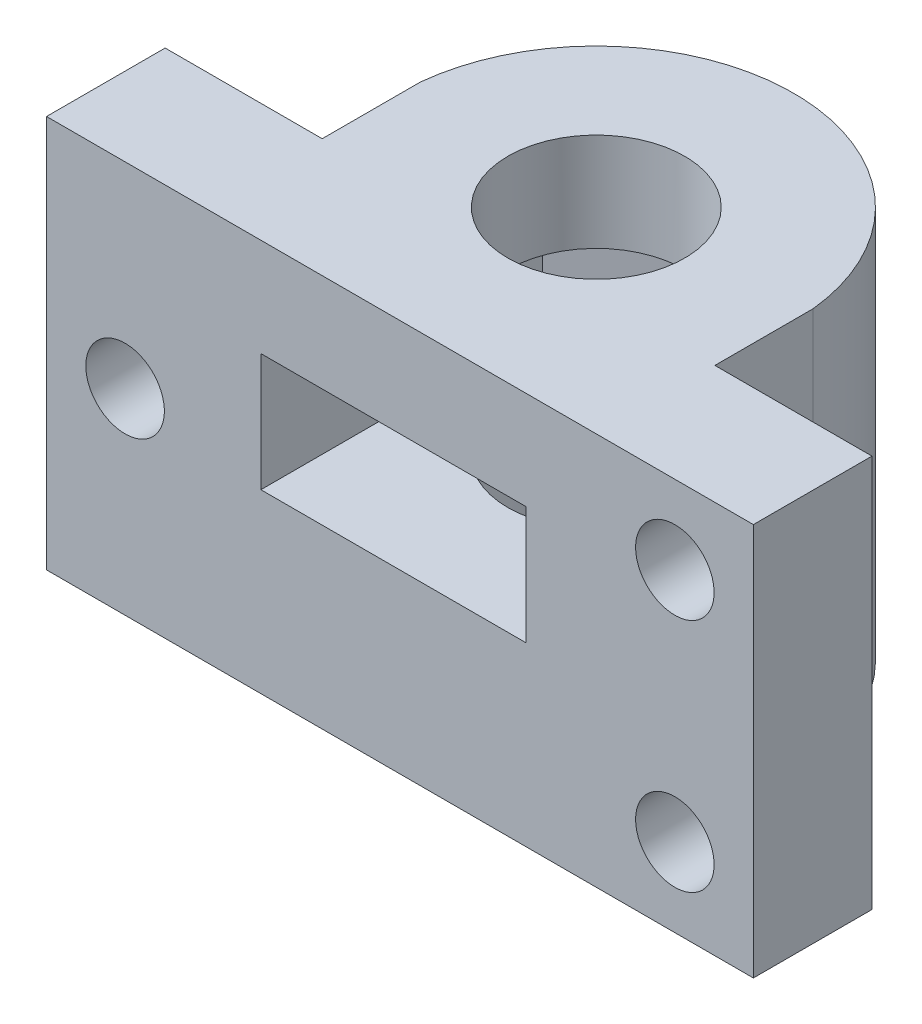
from build123d import *

# Parameters (mm, degrees)
SKETCH1_R           = 4.5
BOSS_EXTRUDE1_DEPTH = 20
CUT_EXTRUDE2_DEPTH  = 6
SKETCH9_R           = 2
CUT_EXTRUDE4_DEPTH  = 38.153619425
SKETCH10_W          = 13.49308662
SKETCH10_H          = 6.005400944
CUT_EXTRUDE5_DEPTH  = 10


with BuildPart() as part:
    # Sketch1 → Boss-Extrude1 (new body)
    with BuildSketch(Plane(origin=(0, 0, 0), x_dir=(1, 0, 0), z_dir=(0, 1, 0))):
        with BuildLine():
            Line((0, 0), (20, 0))
            Line((20, 0), (28, 0))
            Line((28, 0), (28, 6.039957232))
            Line((28, 6.039957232), (20, 6.039957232))
            Line((20, 6.039957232), (20, 11.039957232))
            ThreePointArc((20, 11.039957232), (10, 20.053930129), (0, 11.039957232))
            Line((0, 11.039957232), (0, 6.039957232))
            Line((0, 6.039957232), (-8, 6.039957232))
            Line((-8, 6.039957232), (-8, 0))
            Line((-8, 0), (0, 0))
        make_face()
        with Locations(Location((10, 10, 0), (0, 0, 270))):
            Circle(SKETCH1_R, mode=Mode.SUBTRACT)
    extrude(amount=BOSS_EXTRUDE1_DEPTH)

    # Sketch4 → Cut-Extrude2 (cut)
    with BuildSketch(Plane(origin=(0, 15, 0), x_dir=(1, 0, 0), z_dir=(0, 1, 0))):
        Polygon((10, 2.494446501), (16.5, 6.24722325), (16.5, 13.75277675), (10, 17.505553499), (3.5, 13.75277675), (3.5, 6.24722325), align=None)
    extrude(amount=-CUT_EXTRUDE2_DEPTH, mode=Mode.SUBTRACT)

    # Sketch9 → Cut-Extrude4 (cut, through all)
    with BuildSketch(Plane(origin=(0, 0, -6.039957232), x_dir=(-1, 0, 0), z_dir=(0, 0, -1))):
        with Locations((-24, 4)):
            Circle(SKETCH9_R)
        with Locations((-24, 16)):
            Circle(SKETCH9_R)
        with Locations((4, 10)):
            Circle(SKETCH9_R)
    extrude(amount=-CUT_EXTRUDE4_DEPTH, mode=Mode.SUBTRACT)

    # Sketch10 → Cut-Extrude5 (cut)
    with BuildSketch(Plane(origin=(0, 0, -6.24722325), x_dir=(-1, 0, 0), z_dir=(0, 0, -1))):
        with Locations((-9.663877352, 11.998541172)):
            Rectangle(SKETCH10_W, SKETCH10_H)
    extrude(amount=-CUT_EXTRUDE5_DEPTH, mode=Mode.SUBTRACT)


solid = part.part
